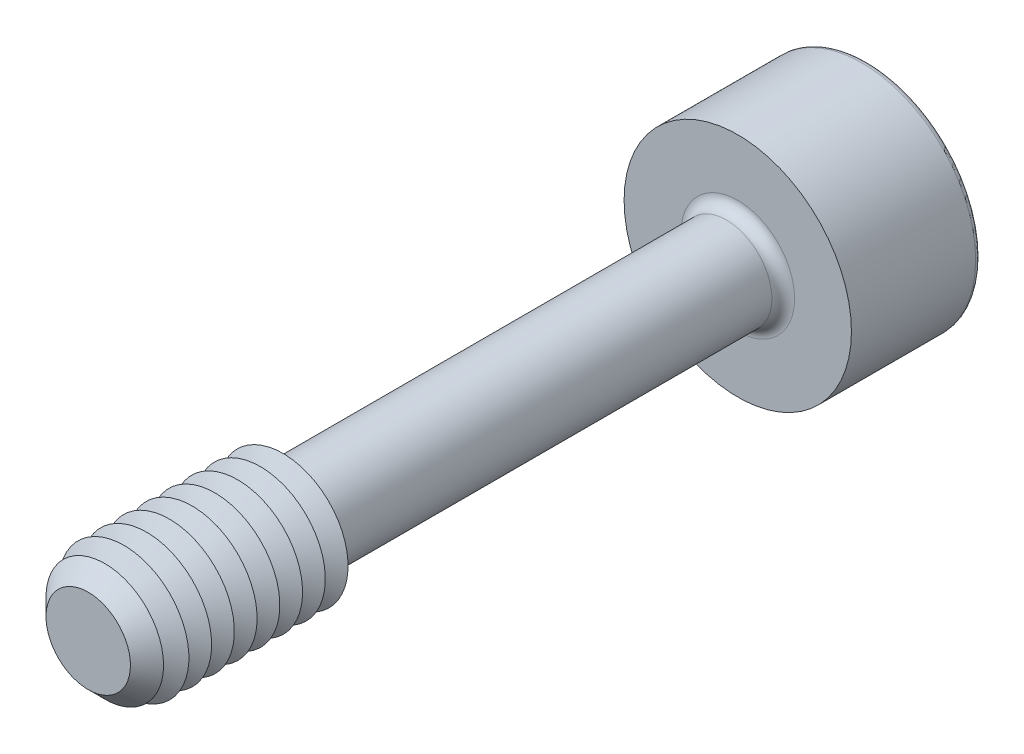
ISO-10303-21;
HEADER;
FILE_DESCRIPTION(('STEP AP214'),'2;1');
FILE_NAME('part.step','',(''),(''),'','','');
FILE_SCHEMA(('AUTOMOTIVE_DESIGN { 1 0 10303 214 1 1 1 1 }'));
ENDSEC;
DATA;
#1=APPLICATION_CONTEXT('core data for automotive mechanical design processes');
#2=APPLICATION_PROTOCOL_DEFINITION('international standard','automotive_design',2000,#1);
#3=PRODUCT_CONTEXT('',#1,'mechanical');
#4=PRODUCT('Part','Part','',(#3));
#5=PRODUCT_RELATED_PRODUCT_CATEGORY('part','',(#4));
#6=PRODUCT_DEFINITION_FORMATION('','',#4);
#7=PRODUCT_DEFINITION_CONTEXT('part definition',#1,'design');
#8=PRODUCT_DEFINITION('design','',#6,#7);
#9=PRODUCT_DEFINITION_SHAPE('','',#8);
#10=(LENGTH_UNIT() NAMED_UNIT(*) SI_UNIT(.MILLI.,.METRE.));
#11=(NAMED_UNIT(*) PLANE_ANGLE_UNIT() SI_UNIT($,.RADIAN.));
#12=(NAMED_UNIT(*) SI_UNIT($,.STERADIAN.) SOLID_ANGLE_UNIT());
#13=UNCERTAINTY_MEASURE_WITH_UNIT(LENGTH_MEASURE(1.E-05),#10,'distance_accuracy_value','');
#14=(GEOMETRIC_REPRESENTATION_CONTEXT(3) GLOBAL_UNCERTAINTY_ASSIGNED_CONTEXT((#13)) GLOBAL_UNIT_ASSIGNED_CONTEXT((#10,
#11,#12)) REPRESENTATION_CONTEXT('',''));
#15=CARTESIAN_POINT('',(0.,0.,0.));
#16=DIRECTION('',(0.,0.,1.));
#17=DIRECTION('',(1.,0.,0.));
#18=AXIS2_PLACEMENT_3D('',#15,#16,#17);
#19=CARTESIAN_POINT('',(-0.866025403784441,-1.5,-11.));
#20=DIRECTION('',(0.,0.,1.));
#21=DIRECTION('',(1.,0.,0.));
#22=AXIS2_PLACEMENT_3D('',#19,#20,#21);
#23=PLANE('',#22);
#24=DIRECTION('',(1.,0.,0.));
#25=VECTOR('',#24,1.);
#26=CARTESIAN_POINT('',(-0.866025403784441,-1.5,-11.));
#27=LINE('',#26,#25);
#28=CARTESIAN_POINT('',(0.,-1.5,-11.));
#29=VERTEX_POINT('',#28);
#30=CARTESIAN_POINT('',(0.866025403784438,-1.5,-11.));
#31=VERTEX_POINT('',#30);
#32=EDGE_CURVE('E761',#29,#31,#27,.T.);
#33=ORIENTED_EDGE('',*,*,#32,.F.);
#34=CARTESIAN_POINT('',(0.,0.,-11.));
#35=DIRECTION('',(0.,0.,1.));
#36=DIRECTION('',(0.,-1.,0.));
#37=AXIS2_PLACEMENT_3D('',#34,#35,#36);
#38=CIRCLE('',#37,1.5);
#39=CARTESIAN_POINT('',(1.29903810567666,-0.75,-11.));
#40=VERTEX_POINT('',#39);
#41=EDGE_CURVE('E53',#29,#40,#38,.T.);
#42=ORIENTED_EDGE('',*,*,#41,.T.);
#43=DIRECTION('',(0.5,0.866025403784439,0.));
#44=VECTOR('',#43,1.);
#45=CARTESIAN_POINT('',(0.866025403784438,-1.5,-11.));
#46=LINE('',#45,#44);
#47=EDGE_CURVE('E747',#31,#40,#46,.T.);
#48=ORIENTED_EDGE('',*,*,#47,.F.);
#49=EDGE_LOOP('',(#33,#42,#48));
#50=FACE_BOUND('',#49,.T.);
#51=ADVANCED_FACE('F41',(#50),#23,.F.);
#52=CARTESIAN_POINT('',(1.73205080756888,0.,-11.));
#53=VERTEX_POINT('',#52);
#54=EDGE_CURVE('E758',#40,#53,#46,.T.);
#55=ORIENTED_EDGE('',*,*,#54,.F.);
#56=CARTESIAN_POINT('',(1.29903810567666,0.749999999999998,-11.));
#57=VERTEX_POINT('',#56);
#58=EDGE_CURVE('E11',#40,#57,#38,.T.);
#59=ORIENTED_EDGE('',*,*,#58,.T.);
#60=DIRECTION('',(-0.5,0.866025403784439,0.));
#61=VECTOR('',#60,1.);
#62=CARTESIAN_POINT('',(1.73205080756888,0.,-11.));
#63=LINE('',#62,#61);
#64=EDGE_CURVE('E746',#53,#57,#63,.T.);
#65=ORIENTED_EDGE('',*,*,#64,.F.);
#66=EDGE_LOOP('',(#55,#59,#65));
#67=FACE_BOUND('',#66,.T.);
#68=ADVANCED_FACE('F133',(#67),#23,.F.);
#69=CARTESIAN_POINT('',(0.866025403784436,1.5,-11.));
#70=VERTEX_POINT('',#69);
#71=EDGE_CURVE('E741',#57,#70,#63,.T.);
#72=ORIENTED_EDGE('',*,*,#71,.F.);
#73=CARTESIAN_POINT('',(0.,1.5,-11.));
#74=VERTEX_POINT('',#73);
#75=EDGE_CURVE('E51',#57,#74,#38,.T.);
#76=ORIENTED_EDGE('',*,*,#75,.T.);
#77=DIRECTION('',(-1.,0.,0.));
#78=VECTOR('',#77,1.);
#79=CARTESIAN_POINT('',(0.866025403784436,1.5,-11.));
#80=LINE('',#79,#78);
#81=EDGE_CURVE('E177',#70,#74,#80,.T.);
#82=ORIENTED_EDGE('',*,*,#81,.F.);
#83=EDGE_LOOP('',(#72,#76,#82));
#84=FACE_BOUND('',#83,.T.);
#85=ADVANCED_FACE('F139',(#84),#23,.F.);
#86=CARTESIAN_POINT('',(-0.866025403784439,1.5,-11.));
#87=VERTEX_POINT('',#86);
#88=EDGE_CURVE('E752',#74,#87,#80,.T.);
#89=ORIENTED_EDGE('',*,*,#88,.F.);
#90=CARTESIAN_POINT('',(-1.29903810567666,0.749999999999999,-11.));
#91=VERTEX_POINT('',#90);
#92=EDGE_CURVE('E264',#74,#91,#38,.T.);
#93=ORIENTED_EDGE('',*,*,#92,.T.);
#94=DIRECTION('',(-0.5,-0.866025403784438,0.));
#95=VECTOR('',#94,1.);
#96=CARTESIAN_POINT('',(-0.866025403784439,1.5,-11.));
#97=LINE('',#96,#95);
#98=EDGE_CURVE('E176',#87,#91,#97,.T.);
#99=ORIENTED_EDGE('',*,*,#98,.F.);
#100=EDGE_LOOP('',(#89,#93,#99));
#101=FACE_BOUND('',#100,.T.);
#102=ADVANCED_FACE('F157',(#101),#23,.F.);
#103=CARTESIAN_POINT('',(-1.73205080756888,0.,-11.));
#104=VERTEX_POINT('',#103);
#105=EDGE_CURVE('E170',#91,#104,#97,.T.);
#106=ORIENTED_EDGE('',*,*,#105,.F.);
#107=CARTESIAN_POINT('',(-1.29903810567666,-0.749999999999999,-11.));
#108=VERTEX_POINT('',#107);
#109=EDGE_CURVE('E172',#91,#108,#38,.T.);
#110=ORIENTED_EDGE('',*,*,#109,.T.);
#111=DIRECTION('',(0.5,-0.866025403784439,0.));
#112=VECTOR('',#111,1.);
#113=CARTESIAN_POINT('',(-1.73205080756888,0.,-11.));
#114=LINE('',#113,#112);
#115=EDGE_CURVE('E174',#104,#108,#114,.T.);
#116=ORIENTED_EDGE('',*,*,#115,.F.);
#117=EDGE_LOOP('',(#106,#110,#116));
#118=FACE_BOUND('',#117,.T.);
#119=ADVANCED_FACE('F146',(#118),#23,.F.);
#120=CARTESIAN_POINT('',(0.,0.,-14.));
#121=DIRECTION('',(0.,0.,-1.));
#122=DIRECTION('',(-1.,0.,0.));
#123=AXIS2_PLACEMENT_3D('',#120,#121,#122);
#124=PLANE('',#123);
#125=CARTESIAN_POINT('',(0.,0.,-14.));
#126=DIRECTION('',(0.,0.,-1.));
#127=DIRECTION('',(-1.,0.,0.));
#128=AXIS2_PLACEMENT_3D('',#125,#126,#127);
#129=CIRCLE('',#128,3.325);
#130=CARTESIAN_POINT('',(-3.325,0.,-14.));
#131=VERTEX_POINT('',#130);
#132=EDGE_CURVE('E251',#131,#131,#129,.T.);
#133=ORIENTED_EDGE('',*,*,#132,.T.);
#134=EDGE_LOOP('',(#133));
#135=FACE_BOUND('',#134,.T.);
#136=DIRECTION('',(-0.5,-0.866025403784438,0.));
#137=VECTOR('',#136,1.);
#138=CARTESIAN_POINT('',(-0.866025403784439,1.5,-14.));
#139=LINE('',#138,#137);
#140=CARTESIAN_POINT('',(-0.866025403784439,1.5,-14.));
#141=VERTEX_POINT('',#140);
#142=CARTESIAN_POINT('',(-1.73205080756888,0.,-14.));
#143=VERTEX_POINT('',#142);
#144=EDGE_CURVE('E212',#141,#143,#139,.T.);
#145=ORIENTED_EDGE('',*,*,#144,.T.);
#146=DIRECTION('',(0.5,-0.866025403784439,0.));
#147=VECTOR('',#146,1.);
#148=CARTESIAN_POINT('',(-1.73205080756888,0.,-14.));
#149=LINE('',#148,#147);
#150=CARTESIAN_POINT('',(-0.866025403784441,-1.5,-14.));
#151=VERTEX_POINT('',#150);
#152=EDGE_CURVE('E67',#143,#151,#149,.T.);
#153=ORIENTED_EDGE('',*,*,#152,.T.);
#154=DIRECTION('',(1.,0.,0.));
#155=VECTOR('',#154,1.);
#156=CARTESIAN_POINT('',(-0.866025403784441,-1.5,-14.));
#157=LINE('',#156,#155);
#158=CARTESIAN_POINT('',(0.866025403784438,-1.5,-14.));
#159=VERTEX_POINT('',#158);
#160=EDGE_CURVE('E196',#151,#159,#157,.T.);
#161=ORIENTED_EDGE('',*,*,#160,.T.);
#162=DIRECTION('',(0.5,0.866025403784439,0.));
#163=VECTOR('',#162,1.);
#164=CARTESIAN_POINT('',(0.866025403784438,-1.5,-14.));
#165=LINE('',#164,#163);
#166=CARTESIAN_POINT('',(1.73205080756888,0.,-14.));
#167=VERTEX_POINT('',#166);
#168=EDGE_CURVE('E200',#159,#167,#165,.T.);
#169=ORIENTED_EDGE('',*,*,#168,.T.);
#170=DIRECTION('',(-0.5,0.866025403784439,0.));
#171=VECTOR('',#170,1.);
#172=CARTESIAN_POINT('',(1.73205080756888,0.,-14.));
#173=LINE('',#172,#171);
#174=CARTESIAN_POINT('',(0.866025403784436,1.5,-14.));
#175=VERTEX_POINT('',#174);
#176=EDGE_CURVE('E204',#167,#175,#173,.T.);
#177=ORIENTED_EDGE('',*,*,#176,.T.);
#178=DIRECTION('',(-1.,0.,0.));
#179=VECTOR('',#178,1.);
#180=CARTESIAN_POINT('',(0.866025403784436,1.5,-14.));
#181=LINE('',#180,#179);
#182=EDGE_CURVE('E208',#175,#141,#181,.T.);
#183=ORIENTED_EDGE('',*,*,#182,.T.);
#184=EDGE_LOOP('',(#145,#153,#161,#169,#177,#183));
#185=FACE_BOUND('',#184,.T.);
#186=ADVANCED_FACE('F156',(#135,#185),#124,.T.);
#187=CARTESIAN_POINT('',(0.,0.,10.));
#188=DIRECTION('',(0.,0.,-1.));
#189=DIRECTION('',(-1.,0.,0.));
#190=AXIS2_PLACEMENT_3D('',#187,#188,#189);
#191=CYLINDRICAL_SURFACE('',#190,1.4);
#192=CARTESIAN_POINT('',(0.,0.,-9.65));
#193=DIRECTION('',(0.,0.,-1.));
#194=DIRECTION('',(-1.,0.,0.));
#195=AXIS2_PLACEMENT_3D('',#192,#193,#194);
#196=CIRCLE('',#195,1.4);
#197=CARTESIAN_POINT('',(-1.4,0.,-9.65));
#198=VERTEX_POINT('',#197);
#199=EDGE_CURVE('E247',#198,#198,#196,.F.);
#200=ORIENTED_EDGE('',*,*,#199,.T.);
#201=EDGE_LOOP('',(#200));
#202=FACE_BOUND('',#201,.T.);
#203=CARTESIAN_POINT('',(0.,0.,3.65358983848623));
#204=DIRECTION('',(0.,0.,-1.));
#205=DIRECTION('',(0.,1.,0.));
#206=AXIS2_PLACEMENT_3D('',#203,#204,#205);
#207=CIRCLE('',#206,1.4);
#208=CARTESIAN_POINT('',(0.,1.4,3.65358983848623));
#209=VERTEX_POINT('',#208);
#210=EDGE_CURVE('E235',#209,#209,#207,.T.);
#211=ORIENTED_EDGE('',*,*,#210,.T.);
#212=EDGE_LOOP('',(#211));
#213=FACE_BOUND('',#212,.T.);
#214=ADVANCED_FACE('F163',(#202,#213),#191,.T.);
#215=CARTESIAN_POINT('',(0.,0.,3.65358983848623));
#216=DIRECTION('',(0.,0.,1.));
#217=DIRECTION('',(0.,-1.,0.));
#218=AXIS2_PLACEMENT_3D('',#215,#216,#217);
#219=CONICAL_SURFACE('',#218,1.4,1.0471975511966);
#220=CARTESIAN_POINT('',(0.,0.,4.));
#221=DIRECTION('',(0.,0.,-1.));
#222=DIRECTION('',(-1.,0.,0.));
#223=AXIS2_PLACEMENT_3D('',#220,#221,#222);
#224=CIRCLE('',#223,2.);
#225=CARTESIAN_POINT('',(-2.,0.,4.));
#226=VERTEX_POINT('',#225);
#227=EDGE_CURVE('E268',#226,#226,#224,.T.);
#228=ORIENTED_EDGE('',*,*,#227,.T.);
#229=EDGE_LOOP('',(#228));
#230=FACE_BOUND('',#229,.T.);
#231=ORIENTED_EDGE('',*,*,#210,.F.);
#232=EDGE_LOOP('',(#231));
#233=FACE_BOUND('',#232,.T.);
#234=ADVANCED_FACE('F510',(#230,#233),#219,.T.);
#235=CARTESIAN_POINT('',(0.,0.,-10.));
#236=DIRECTION('',(0.,0.,-1.));
#237=DIRECTION('',(-1.,0.,0.));
#238=AXIS2_PLACEMENT_3D('',#235,#236,#237);
#239=PLANE('',#238);
#240=CARTESIAN_POINT('',(0.,0.,-10.));
#241=DIRECTION('',(0.,0.,-1.));
#242=DIRECTION('',(-1.,0.,0.));
#243=AXIS2_PLACEMENT_3D('',#240,#241,#242);
#244=CIRCLE('',#243,1.75);
#245=CARTESIAN_POINT('',(-1.75,0.,-10.));
#246=VERTEX_POINT('',#245);
#247=EDGE_CURVE('E243',#246,#246,#244,.T.);
#248=ORIENTED_EDGE('',*,*,#247,.T.);
#249=EDGE_LOOP('',(#248));
#250=FACE_BOUND('',#249,.T.);
#251=CARTESIAN_POINT('',(0.,0.,-10.));
#252=DIRECTION('',(0.,0.,-1.));
#253=DIRECTION('',(-1.,0.,0.));
#254=AXIS2_PLACEMENT_3D('',#251,#252,#253);
#255=CIRCLE('',#254,3.5);
#256=CARTESIAN_POINT('',(-3.5,0.,-10.));
#257=VERTEX_POINT('',#256);
#258=EDGE_CURVE('E231',#257,#257,#255,.T.);
#259=ORIENTED_EDGE('',*,*,#258,.F.);
#260=EDGE_LOOP('',(#259));
#261=FACE_BOUND('',#260,.T.);
#262=ADVANCED_FACE('F503',(#250,#261),#239,.F.);
#263=CARTESIAN_POINT('',(0.,0.,-14.));
#264=DIRECTION('',(0.,0.,1.));
#265=DIRECTION('',(1.,0.,0.));
#266=AXIS2_PLACEMENT_3D('',#263,#264,#265);
#267=CYLINDRICAL_SURFACE('',#266,3.5);
#268=CARTESIAN_POINT('',(0.,0.,-13.825));
#269=DIRECTION('',(0.,0.,-1.));
#270=DIRECTION('',(-1.,0.,0.));
#271=AXIS2_PLACEMENT_3D('',#268,#269,#270);
#272=CIRCLE('',#271,3.5);
#273=CARTESIAN_POINT('',(-3.5,0.,-13.825));
#274=VERTEX_POINT('',#273);
#275=EDGE_CURVE('E254',#274,#274,#272,.F.);
#276=ORIENTED_EDGE('',*,*,#275,.T.);
#277=EDGE_LOOP('',(#276));
#278=FACE_BOUND('',#277,.T.);
#279=ORIENTED_EDGE('',*,*,#258,.T.);
#280=EDGE_LOOP('',(#279));
#281=FACE_BOUND('',#280,.T.);
#282=ADVANCED_FACE('F509',(#278,#281),#267,.T.);
#283=CARTESIAN_POINT('',(-1.73205080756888,0.,-11.));
#284=DIRECTION('',(0.866025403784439,0.5,0.));
#285=DIRECTION('',(-0.5,0.866025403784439,0.));
#286=AXIS2_PLACEMENT_3D('',#283,#284,#285);
#287=PLANE('',#286);
#288=ORIENTED_EDGE('',*,*,#152,.F.);
#289=DIRECTION('',(0.,0.,-1.));
#290=VECTOR('',#289,1.);
#291=CARTESIAN_POINT('',(-1.73205080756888,0.,-11.));
#292=LINE('',#291,#290);
#293=EDGE_CURVE('E186',#104,#143,#292,.T.);
#294=ORIENTED_EDGE('',*,*,#293,.F.);
#295=ORIENTED_EDGE('',*,*,#115,.T.);
#296=CARTESIAN_POINT('',(-0.866025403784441,-1.5,-11.));
#297=VERTEX_POINT('',#296);
#298=EDGE_CURVE('E215',#108,#297,#114,.T.);
#299=ORIENTED_EDGE('',*,*,#298,.T.);
#300=DIRECTION('',(0.,0.,-1.));
#301=VECTOR('',#300,1.);
#302=CARTESIAN_POINT('',(-0.866025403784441,-1.5,-11.));
#303=LINE('',#302,#301);
#304=EDGE_CURVE('E228',#297,#151,#303,.T.);
#305=ORIENTED_EDGE('',*,*,#304,.T.);
#306=EDGE_LOOP('',(#288,#294,#295,#299,#305));
#307=FACE_BOUND('',#306,.T.);
#308=ADVANCED_FACE('F521',(#307),#287,.T.);
#309=CARTESIAN_POINT('',(-0.866025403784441,-1.5,-11.));
#310=DIRECTION('',(0.,1.,0.));
#311=DIRECTION('',(0.,0.,1.));
#312=AXIS2_PLACEMENT_3D('',#309,#310,#311);
#313=PLANE('',#312);
#314=ORIENTED_EDGE('',*,*,#160,.F.);
#315=ORIENTED_EDGE('',*,*,#304,.F.);
#316=EDGE_CURVE('E759',#297,#29,#27,.T.);
#317=ORIENTED_EDGE('',*,*,#316,.T.);
#318=ORIENTED_EDGE('',*,*,#32,.T.);
#319=DIRECTION('',(0.,0.,-1.));
#320=VECTOR('',#319,1.);
#321=CARTESIAN_POINT('',(0.866025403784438,-1.5,-11.));
#322=LINE('',#321,#320);
#323=EDGE_CURVE('E225',#31,#159,#322,.T.);
#324=ORIENTED_EDGE('',*,*,#323,.T.);
#325=EDGE_LOOP('',(#314,#315,#317,#318,#324));
#326=FACE_BOUND('',#325,.T.);
#327=ADVANCED_FACE('F537',(#326),#313,.T.);
#328=CARTESIAN_POINT('',(0.866025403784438,-1.5,-11.));
#329=DIRECTION('',(-0.866025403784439,0.5,0.));
#330=DIRECTION('',(-0.5,-0.866025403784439,0.));
#331=AXIS2_PLACEMENT_3D('',#328,#329,#330);
#332=PLANE('',#331);
#333=ORIENTED_EDGE('',*,*,#168,.F.);
#334=ORIENTED_EDGE('',*,*,#323,.F.);
#335=ORIENTED_EDGE('',*,*,#47,.T.);
#336=ORIENTED_EDGE('',*,*,#54,.T.);
#337=DIRECTION('',(0.,0.,-1.));
#338=VECTOR('',#337,1.);
#339=CARTESIAN_POINT('',(1.73205080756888,0.,-11.));
#340=LINE('',#339,#338);
#341=EDGE_CURVE('E222',#53,#167,#340,.T.);
#342=ORIENTED_EDGE('',*,*,#341,.T.);
#343=EDGE_LOOP('',(#333,#334,#335,#336,#342));
#344=FACE_BOUND('',#343,.T.);
#345=ADVANCED_FACE('F547',(#344),#332,.T.);
#346=CARTESIAN_POINT('',(1.73205080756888,0.,-11.));
#347=DIRECTION('',(-0.866025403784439,-0.5,0.));
#348=DIRECTION('',(0.5,-0.866025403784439,0.));
#349=AXIS2_PLACEMENT_3D('',#346,#347,#348);
#350=PLANE('',#349);
#351=ORIENTED_EDGE('',*,*,#176,.F.);
#352=ORIENTED_EDGE('',*,*,#341,.F.);
#353=ORIENTED_EDGE('',*,*,#64,.T.);
#354=ORIENTED_EDGE('',*,*,#71,.T.);
#355=DIRECTION('',(0.,0.,-1.));
#356=VECTOR('',#355,1.);
#357=CARTESIAN_POINT('',(0.866025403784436,1.5,-11.));
#358=LINE('',#357,#356);
#359=EDGE_CURVE('E219',#70,#175,#358,.T.);
#360=ORIENTED_EDGE('',*,*,#359,.T.);
#361=EDGE_LOOP('',(#351,#352,#353,#354,#360));
#362=FACE_BOUND('',#361,.T.);
#363=ADVANCED_FACE('F557',(#362),#350,.T.);
#364=CARTESIAN_POINT('',(0.866025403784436,1.5,-11.));
#365=DIRECTION('',(0.,-1.,0.));
#366=DIRECTION('',(0.,0.,-1.));
#367=AXIS2_PLACEMENT_3D('',#364,#365,#366);
#368=PLANE('',#367);
#369=ORIENTED_EDGE('',*,*,#182,.F.);
#370=ORIENTED_EDGE('',*,*,#359,.F.);
#371=ORIENTED_EDGE('',*,*,#81,.T.);
#372=ORIENTED_EDGE('',*,*,#88,.T.);
#373=DIRECTION('',(0.,0.,-1.));
#374=VECTOR('',#373,1.);
#375=CARTESIAN_POINT('',(-0.866025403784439,1.5,-11.));
#376=LINE('',#375,#374);
#377=EDGE_CURVE('E182',#87,#141,#376,.T.);
#378=ORIENTED_EDGE('',*,*,#377,.T.);
#379=EDGE_LOOP('',(#369,#370,#371,#372,#378));
#380=FACE_BOUND('',#379,.T.);
#381=ADVANCED_FACE('F152',(#380),#368,.T.);
#382=CARTESIAN_POINT('',(-0.866025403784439,1.5,-11.));
#383=DIRECTION('',(0.866025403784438,-0.5,0.));
#384=DIRECTION('',(0.5,0.866025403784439,0.));
#385=AXIS2_PLACEMENT_3D('',#382,#383,#384);
#386=PLANE('',#385);
#387=ORIENTED_EDGE('',*,*,#144,.F.);
#388=ORIENTED_EDGE('',*,*,#377,.F.);
#389=ORIENTED_EDGE('',*,*,#98,.T.);
#390=ORIENTED_EDGE('',*,*,#105,.T.);
#391=ORIENTED_EDGE('',*,*,#293,.T.);
#392=EDGE_LOOP('',(#387,#388,#389,#390,#391));
#393=FACE_BOUND('',#392,.T.);
#394=ADVANCED_FACE('F144',(#393),#386,.T.);
#395=ORIENTED_EDGE('',*,*,#298,.F.);
#396=EDGE_CURVE('E257',#108,#29,#38,.T.);
#397=ORIENTED_EDGE('',*,*,#396,.T.);
#398=ORIENTED_EDGE('',*,*,#316,.F.);
#399=EDGE_LOOP('',(#395,#397,#398));
#400=FACE_BOUND('',#399,.T.);
#401=ADVANCED_FACE('F135',(#400),#23,.F.);
#402=CARTESIAN_POINT('',(0.,0.,-9.65));
#403=DIRECTION('',(0.,0.,-1.));
#404=DIRECTION('',(-1.,0.,0.));
#405=AXIS2_PLACEMENT_3D('',#402,#403,#404);
#406=TOROIDAL_SURFACE('',#405,1.75,0.35);
#407=ORIENTED_EDGE('',*,*,#199,.F.);
#408=EDGE_LOOP('',(#407));
#409=FACE_BOUND('',#408,.T.);
#410=ORIENTED_EDGE('',*,*,#247,.F.);
#411=EDGE_LOOP('',(#410));
#412=FACE_BOUND('',#411,.T.);
#413=ADVANCED_FACE('F129',(#409,#412),#406,.F.);
#414=CARTESIAN_POINT('',(0.,0.,-13.825));
#415=DIRECTION('',(0.,0.,-1.));
#416=DIRECTION('',(-1.,0.,0.));
#417=AXIS2_PLACEMENT_3D('',#414,#415,#416);
#418=TOROIDAL_SURFACE('',#417,3.325,0.175);
#419=ORIENTED_EDGE('',*,*,#275,.F.);
#420=EDGE_LOOP('',(#419));
#421=FACE_BOUND('',#420,.T.);
#422=ORIENTED_EDGE('',*,*,#132,.F.);
#423=EDGE_LOOP('',(#422));
#424=FACE_BOUND('',#423,.T.);
#425=ADVANCED_FACE('F43',(#421,#424),#418,.T.);
#426=CARTESIAN_POINT('',(0.,0.,-10.1339745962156));
#427=DIRECTION('',(0.,0.,-1.));
#428=DIRECTION('',(0.,1.,0.));
#429=AXIS2_PLACEMENT_3D('',#426,#427,#428);
#430=CONICAL_SURFACE('',#429,0.,1.0471975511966);
#431=ORIENTED_EDGE('',*,*,#41,.F.);
#432=ORIENTED_EDGE('',*,*,#396,.F.);
#433=ORIENTED_EDGE('',*,*,#109,.F.);
#434=ORIENTED_EDGE('',*,*,#92,.F.);
#435=ORIENTED_EDGE('',*,*,#75,.F.);
#436=ORIENTED_EDGE('',*,*,#58,.F.);
#437=EDGE_LOOP('',(#431,#432,#433,#434,#435,#436));
#438=FACE_BOUND('',#437,.T.);
#439=CARTESIAN_POINT('',(0.,0.,-10.1339745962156));
#440=VERTEX_POINT('',#439);
#441=VERTEX_LOOP('',#440);
#442=FACE_BOUND('',#441,.T.);
#443=ADVANCED_FACE('F118',(#438,#442),#430,.F.);
#444=CARTESIAN_POINT('',(0.,0.,4.35));
#445=DIRECTION('',(0.,0.,-1.));
#446=DIRECTION('',(-1.,0.,0.));
#447=AXIS2_PLACEMENT_3D('',#444,#445,#446);
#448=CONICAL_SURFACE('',#447,1.39378221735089,1.0471975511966);
#449=ORIENTED_EDGE('',*,*,#227,.F.);
#450=EDGE_LOOP('',(#449));
#451=FACE_BOUND('',#450,.T.);
#452=CARTESIAN_POINT('',(0.,0.,4.35));
#453=DIRECTION('',(0.,0.,-1.));
#454=DIRECTION('',(-1.,0.,0.));
#455=AXIS2_PLACEMENT_3D('',#452,#453,#454);
#456=CIRCLE('',#455,1.39378221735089);
#457=CARTESIAN_POINT('',(-1.39378221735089,0.,4.35));
#458=VERTEX_POINT('',#457);
#459=EDGE_CURVE('E275',#458,#458,#456,.T.);
#460=ORIENTED_EDGE('',*,*,#459,.T.);
#461=EDGE_LOOP('',(#460));
#462=FACE_BOUND('',#461,.T.);
#463=ADVANCED_FACE('F120',(#451,#462),#448,.T.);
#464=CARTESIAN_POINT('',(0.,0.,4.7));
#465=DIRECTION('',(0.,0.,1.));
#466=DIRECTION('',(1.,0.,0.));
#467=AXIS2_PLACEMENT_3D('',#464,#465,#466);
#468=CONICAL_SURFACE('',#467,2.,1.0471975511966);
#469=ORIENTED_EDGE('',*,*,#459,.F.);
#470=EDGE_LOOP('',(#469));
#471=FACE_BOUND('',#470,.T.);
#472=CARTESIAN_POINT('',(0.,0.,4.7));
#473=DIRECTION('',(0.,0.,-1.));
#474=DIRECTION('',(-1.,0.,0.));
#475=AXIS2_PLACEMENT_3D('',#472,#473,#474);
#476=CIRCLE('',#475,2.);
#477=CARTESIAN_POINT('',(-2.,0.,4.7));
#478=VERTEX_POINT('',#477);
#479=EDGE_CURVE('E281',#478,#478,#476,.T.);
#480=ORIENTED_EDGE('',*,*,#479,.T.);
#481=EDGE_LOOP('',(#480));
#482=FACE_BOUND('',#481,.T.);
#483=ADVANCED_FACE('F126',(#471,#482),#468,.T.);
#484=CARTESIAN_POINT('',(0.,0.,5.05));
#485=DIRECTION('',(0.,0.,-1.));
#486=DIRECTION('',(-1.,0.,0.));
#487=AXIS2_PLACEMENT_3D('',#484,#485,#486);
#488=CONICAL_SURFACE('',#487,1.39378221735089,1.0471975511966);
#489=ORIENTED_EDGE('',*,*,#479,.F.);
#490=EDGE_LOOP('',(#489));
#491=FACE_BOUND('',#490,.T.);
#492=CARTESIAN_POINT('',(0.,0.,5.05));
#493=DIRECTION('',(0.,0.,-1.));
#494=DIRECTION('',(-1.,0.,0.));
#495=AXIS2_PLACEMENT_3D('',#492,#493,#494);
#496=CIRCLE('',#495,1.39378221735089);
#497=CARTESIAN_POINT('',(-1.39378221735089,0.,5.05));
#498=VERTEX_POINT('',#497);
#499=EDGE_CURVE('E286',#498,#498,#496,.T.);
#500=ORIENTED_EDGE('',*,*,#499,.T.);
#501=EDGE_LOOP('',(#500));
#502=FACE_BOUND('',#501,.T.);
#503=ADVANCED_FACE('F397',(#491,#502),#488,.T.);
#504=CARTESIAN_POINT('',(0.,0.,5.4));
#505=DIRECTION('',(0.,0.,1.));
#506=DIRECTION('',(1.,0.,0.));
#507=AXIS2_PLACEMENT_3D('',#504,#505,#506);
#508=CONICAL_SURFACE('',#507,2.,1.0471975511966);
#509=ORIENTED_EDGE('',*,*,#499,.F.);
#510=EDGE_LOOP('',(#509));
#511=FACE_BOUND('',#510,.T.);
#512=CARTESIAN_POINT('',(0.,0.,5.4));
#513=DIRECTION('',(0.,0.,-1.));
#514=DIRECTION('',(-1.,0.,0.));
#515=AXIS2_PLACEMENT_3D('',#512,#513,#514);
#516=CIRCLE('',#515,2.);
#517=CARTESIAN_POINT('',(-2.,0.,5.4));
#518=VERTEX_POINT('',#517);
#519=EDGE_CURVE('E289',#518,#518,#516,.T.);
#520=ORIENTED_EDGE('',*,*,#519,.T.);
#521=EDGE_LOOP('',(#520));
#522=FACE_BOUND('',#521,.T.);
#523=ADVANCED_FACE('F393',(#511,#522),#508,.T.);
#524=CARTESIAN_POINT('',(0.,0.,5.75));
#525=DIRECTION('',(0.,0.,-1.));
#526=DIRECTION('',(-1.,0.,0.));
#527=AXIS2_PLACEMENT_3D('',#524,#525,#526);
#528=CONICAL_SURFACE('',#527,1.39378221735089,1.0471975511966);
#529=ORIENTED_EDGE('',*,*,#519,.F.);
#530=EDGE_LOOP('',(#529));
#531=FACE_BOUND('',#530,.T.);
#532=CARTESIAN_POINT('',(0.,0.,5.75));
#533=DIRECTION('',(0.,0.,-1.));
#534=DIRECTION('',(-1.,0.,0.));
#535=AXIS2_PLACEMENT_3D('',#532,#533,#534);
#536=CIRCLE('',#535,1.39378221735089);
#537=CARTESIAN_POINT('',(-1.39378221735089,0.,5.75));
#538=VERTEX_POINT('',#537);
#539=EDGE_CURVE('E293',#538,#538,#536,.T.);
#540=ORIENTED_EDGE('',*,*,#539,.T.);
#541=EDGE_LOOP('',(#540));
#542=FACE_BOUND('',#541,.T.);
#543=ADVANCED_FACE('F389',(#531,#542),#528,.T.);
#544=CARTESIAN_POINT('',(0.,0.,6.1));
#545=DIRECTION('',(0.,0.,1.));
#546=DIRECTION('',(1.,0.,0.));
#547=AXIS2_PLACEMENT_3D('',#544,#545,#546);
#548=CONICAL_SURFACE('',#547,2.,1.0471975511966);
#549=ORIENTED_EDGE('',*,*,#539,.F.);
#550=EDGE_LOOP('',(#549));
#551=FACE_BOUND('',#550,.T.);
#552=CARTESIAN_POINT('',(0.,0.,6.1));
#553=DIRECTION('',(0.,0.,-1.));
#554=DIRECTION('',(-1.,0.,0.));
#555=AXIS2_PLACEMENT_3D('',#552,#553,#554);
#556=CIRCLE('',#555,2.);
#557=CARTESIAN_POINT('',(-2.,0.,6.1));
#558=VERTEX_POINT('',#557);
#559=EDGE_CURVE('E296',#558,#558,#556,.T.);
#560=ORIENTED_EDGE('',*,*,#559,.T.);
#561=EDGE_LOOP('',(#560));
#562=FACE_BOUND('',#561,.T.);
#563=ADVANCED_FACE('F385',(#551,#562),#548,.T.);
#564=CARTESIAN_POINT('',(0.,0.,6.45));
#565=DIRECTION('',(0.,0.,-1.));
#566=DIRECTION('',(-1.,0.,0.));
#567=AXIS2_PLACEMENT_3D('',#564,#565,#566);
#568=CONICAL_SURFACE('',#567,1.39378221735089,1.0471975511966);
#569=ORIENTED_EDGE('',*,*,#559,.F.);
#570=EDGE_LOOP('',(#569));
#571=FACE_BOUND('',#570,.T.);
#572=CARTESIAN_POINT('',(0.,0.,6.45));
#573=DIRECTION('',(0.,0.,-1.));
#574=DIRECTION('',(-1.,0.,0.));
#575=AXIS2_PLACEMENT_3D('',#572,#573,#574);
#576=CIRCLE('',#575,1.39378221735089);
#577=CARTESIAN_POINT('',(-1.39378221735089,0.,6.45));
#578=VERTEX_POINT('',#577);
#579=EDGE_CURVE('E300',#578,#578,#576,.T.);
#580=ORIENTED_EDGE('',*,*,#579,.T.);
#581=EDGE_LOOP('',(#580));
#582=FACE_BOUND('',#581,.T.);
#583=ADVANCED_FACE('F381',(#571,#582),#568,.T.);
#584=CARTESIAN_POINT('',(0.,0.,6.8));
#585=DIRECTION('',(0.,0.,1.));
#586=DIRECTION('',(1.,0.,0.));
#587=AXIS2_PLACEMENT_3D('',#584,#585,#586);
#588=CONICAL_SURFACE('',#587,2.,1.0471975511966);
#589=ORIENTED_EDGE('',*,*,#579,.F.);
#590=EDGE_LOOP('',(#589));
#591=FACE_BOUND('',#590,.T.);
#592=CARTESIAN_POINT('',(0.,0.,6.8));
#593=DIRECTION('',(0.,0.,-1.));
#594=DIRECTION('',(-1.,0.,0.));
#595=AXIS2_PLACEMENT_3D('',#592,#593,#594);
#596=CIRCLE('',#595,2.);
#597=CARTESIAN_POINT('',(-2.,0.,6.8));
#598=VERTEX_POINT('',#597);
#599=EDGE_CURVE('E304',#598,#598,#596,.T.);
#600=ORIENTED_EDGE('',*,*,#599,.T.);
#601=EDGE_LOOP('',(#600));
#602=FACE_BOUND('',#601,.T.);
#603=ADVANCED_FACE('F377',(#591,#602),#588,.T.);
#604=CARTESIAN_POINT('',(0.,0.,7.15));
#605=DIRECTION('',(0.,0.,-1.));
#606=DIRECTION('',(-1.,0.,0.));
#607=AXIS2_PLACEMENT_3D('',#604,#605,#606);
#608=CONICAL_SURFACE('',#607,1.39378221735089,1.0471975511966);
#609=ORIENTED_EDGE('',*,*,#599,.F.);
#610=EDGE_LOOP('',(#609));
#611=FACE_BOUND('',#610,.T.);
#612=CARTESIAN_POINT('',(0.,0.,7.15));
#613=DIRECTION('',(0.,0.,-1.));
#614=DIRECTION('',(-1.,0.,0.));
#615=AXIS2_PLACEMENT_3D('',#612,#613,#614);
#616=CIRCLE('',#615,1.39378221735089);
#617=CARTESIAN_POINT('',(-1.39378221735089,0.,7.15));
#618=VERTEX_POINT('',#617);
#619=EDGE_CURVE('E307',#618,#618,#616,.T.);
#620=ORIENTED_EDGE('',*,*,#619,.T.);
#621=EDGE_LOOP('',(#620));
#622=FACE_BOUND('',#621,.T.);
#623=ADVANCED_FACE('F373',(#611,#622),#608,.T.);
#624=CARTESIAN_POINT('',(0.,0.,7.5));
#625=DIRECTION('',(0.,0.,1.));
#626=DIRECTION('',(1.,0.,0.));
#627=AXIS2_PLACEMENT_3D('',#624,#625,#626);
#628=CONICAL_SURFACE('',#627,2.,1.0471975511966);
#629=ORIENTED_EDGE('',*,*,#619,.F.);
#630=EDGE_LOOP('',(#629));
#631=FACE_BOUND('',#630,.T.);
#632=CARTESIAN_POINT('',(0.,0.,7.5));
#633=DIRECTION('',(0.,0.,-1.));
#634=DIRECTION('',(-1.,0.,0.));
#635=AXIS2_PLACEMENT_3D('',#632,#633,#634);
#636=CIRCLE('',#635,2.);
#637=CARTESIAN_POINT('',(-2.,0.,7.5));
#638=VERTEX_POINT('',#637);
#639=EDGE_CURVE('E311',#638,#638,#636,.T.);
#640=ORIENTED_EDGE('',*,*,#639,.T.);
#641=EDGE_LOOP('',(#640));
#642=FACE_BOUND('',#641,.T.);
#643=ADVANCED_FACE('F369',(#631,#642),#628,.T.);
#644=CARTESIAN_POINT('',(0.,0.,7.85));
#645=DIRECTION('',(0.,0.,-1.));
#646=DIRECTION('',(-1.,0.,0.));
#647=AXIS2_PLACEMENT_3D('',#644,#645,#646);
#648=CONICAL_SURFACE('',#647,1.39378221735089,1.0471975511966);
#649=ORIENTED_EDGE('',*,*,#639,.F.);
#650=EDGE_LOOP('',(#649));
#651=FACE_BOUND('',#650,.T.);
#652=CARTESIAN_POINT('',(0.,0.,7.85));
#653=DIRECTION('',(0.,0.,-1.));
#654=DIRECTION('',(-1.,0.,0.));
#655=AXIS2_PLACEMENT_3D('',#652,#653,#654);
#656=CIRCLE('',#655,1.39378221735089);
#657=CARTESIAN_POINT('',(-1.39378221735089,0.,7.85));
#658=VERTEX_POINT('',#657);
#659=EDGE_CURVE('E314',#658,#658,#656,.T.);
#660=ORIENTED_EDGE('',*,*,#659,.T.);
#661=EDGE_LOOP('',(#660));
#662=FACE_BOUND('',#661,.T.);
#663=ADVANCED_FACE('F365',(#651,#662),#648,.T.);
#664=CARTESIAN_POINT('',(0.,0.,8.2));
#665=DIRECTION('',(0.,0.,1.));
#666=DIRECTION('',(1.,0.,0.));
#667=AXIS2_PLACEMENT_3D('',#664,#665,#666);
#668=CONICAL_SURFACE('',#667,2.,1.0471975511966);
#669=ORIENTED_EDGE('',*,*,#659,.F.);
#670=EDGE_LOOP('',(#669));
#671=FACE_BOUND('',#670,.T.);
#672=CARTESIAN_POINT('',(0.,0.,8.2));
#673=DIRECTION('',(0.,0.,-1.));
#674=DIRECTION('',(-1.,0.,0.));
#675=AXIS2_PLACEMENT_3D('',#672,#673,#674);
#676=CIRCLE('',#675,2.);
#677=CARTESIAN_POINT('',(-2.,0.,8.2));
#678=VERTEX_POINT('',#677);
#679=EDGE_CURVE('E318',#678,#678,#676,.T.);
#680=ORIENTED_EDGE('',*,*,#679,.T.);
#681=EDGE_LOOP('',(#680));
#682=FACE_BOUND('',#681,.T.);
#683=ADVANCED_FACE('F361',(#671,#682),#668,.T.);
#684=CARTESIAN_POINT('',(0.,0.,8.55));
#685=DIRECTION('',(0.,0.,-1.));
#686=DIRECTION('',(-1.,0.,0.));
#687=AXIS2_PLACEMENT_3D('',#684,#685,#686);
#688=CONICAL_SURFACE('',#687,1.39378221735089,1.0471975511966);
#689=ORIENTED_EDGE('',*,*,#679,.F.);
#690=EDGE_LOOP('',(#689));
#691=FACE_BOUND('',#690,.T.);
#692=CARTESIAN_POINT('',(0.,0.,8.55));
#693=DIRECTION('',(0.,0.,-1.));
#694=DIRECTION('',(-1.,0.,0.));
#695=AXIS2_PLACEMENT_3D('',#692,#693,#694);
#696=CIRCLE('',#695,1.39378221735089);
#697=CARTESIAN_POINT('',(-1.39378221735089,0.,8.55));
#698=VERTEX_POINT('',#697);
#699=EDGE_CURVE('E322',#698,#698,#696,.T.);
#700=ORIENTED_EDGE('',*,*,#699,.T.);
#701=EDGE_LOOP('',(#700));
#702=FACE_BOUND('',#701,.T.);
#703=ADVANCED_FACE('F357',(#691,#702),#688,.T.);
#704=CARTESIAN_POINT('',(0.,0.,8.9));
#705=DIRECTION('',(0.,0.,1.));
#706=DIRECTION('',(1.,0.,0.));
#707=AXIS2_PLACEMENT_3D('',#704,#705,#706);
#708=CONICAL_SURFACE('',#707,2.,1.0471975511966);
#709=ORIENTED_EDGE('',*,*,#699,.F.);
#710=EDGE_LOOP('',(#709));
#711=FACE_BOUND('',#710,.T.);
#712=CARTESIAN_POINT('',(0.,0.,8.9));
#713=DIRECTION('',(0.,0.,-1.));
#714=DIRECTION('',(-1.,0.,0.));
#715=AXIS2_PLACEMENT_3D('',#712,#713,#714);
#716=CIRCLE('',#715,2.);
#717=CARTESIAN_POINT('',(-2.,0.,8.9));
#718=VERTEX_POINT('',#717);
#719=EDGE_CURVE('E326',#718,#718,#716,.T.);
#720=ORIENTED_EDGE('',*,*,#719,.T.);
#721=EDGE_LOOP('',(#720));
#722=FACE_BOUND('',#721,.T.);
#723=ADVANCED_FACE('F350',(#711,#722),#708,.T.);
#724=CARTESIAN_POINT('',(0.,0.,9.25));
#725=DIRECTION('',(0.,0.,-1.));
#726=DIRECTION('',(-1.,0.,0.));
#727=AXIS2_PLACEMENT_3D('',#724,#725,#726);
#728=CONICAL_SURFACE('',#727,1.39378221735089,1.0471975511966);
#729=ORIENTED_EDGE('',*,*,#719,.F.);
#730=EDGE_LOOP('',(#729));
#731=FACE_BOUND('',#730,.T.);
#732=CARTESIAN_POINT('',(0.,0.,9.25));
#733=DIRECTION('',(0.,0.,-1.));
#734=DIRECTION('',(-1.,0.,0.));
#735=AXIS2_PLACEMENT_3D('',#732,#733,#734);
#736=CIRCLE('',#735,1.39378221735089);
#737=CARTESIAN_POINT('',(-1.39378221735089,0.,9.25));
#738=VERTEX_POINT('',#737);
#739=EDGE_CURVE('E330',#738,#738,#736,.T.);
#740=ORIENTED_EDGE('',*,*,#739,.T.);
#741=EDGE_LOOP('',(#740));
#742=FACE_BOUND('',#741,.T.);
#743=ADVANCED_FACE('F336',(#731,#742),#728,.T.);
#744=CARTESIAN_POINT('',(0.,0.,9.6));
#745=DIRECTION('',(0.,0.,1.));
#746=DIRECTION('',(1.,0.,0.));
#747=AXIS2_PLACEMENT_3D('',#744,#745,#746);
#748=CONICAL_SURFACE('',#747,2.,1.0471975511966);
#749=CARTESIAN_POINT('',(0.,0.,9.49019237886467));
#750=DIRECTION('',(0.,0.,1.));
#751=DIRECTION('',(1.,0.,0.));
#752=AXIS2_PLACEMENT_3D('',#749,#750,#751);
#753=CIRCLE('',#752,1.80980762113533);
#754=CARTESIAN_POINT('',(1.80980762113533,0.,9.49019237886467));
#755=VERTEX_POINT('',#754);
#756=EDGE_CURVE('E45',#755,#755,#753,.F.);
#757=ORIENTED_EDGE('',*,*,#756,.T.);
#758=EDGE_LOOP('',(#757));
#759=FACE_BOUND('',#758,.T.);
#760=ORIENTED_EDGE('',*,*,#739,.F.);
#761=EDGE_LOOP('',(#760));
#762=FACE_BOUND('',#761,.T.);
#763=ADVANCED_FACE('F338',(#759,#762),#748,.T.);
#764=CARTESIAN_POINT('',(0.,0.,10.));
#765=DIRECTION('',(0.,0.,1.));
#766=DIRECTION('',(1.,0.,0.));
#767=AXIS2_PLACEMENT_3D('',#764,#765,#766);
#768=PLANE('',#767);
#769=CARTESIAN_POINT('',(0.,0.,10.));
#770=DIRECTION('',(0.,0.,1.));
#771=DIRECTION('',(1.,0.,0.));
#772=AXIS2_PLACEMENT_3D('',#769,#770,#771);
#773=CIRCLE('',#772,1.3);
#774=CARTESIAN_POINT('',(1.3,0.,10.));
#775=VERTEX_POINT('',#774);
#776=EDGE_CURVE('E239',#775,#775,#773,.T.);
#777=ORIENTED_EDGE('',*,*,#776,.T.);
#778=EDGE_LOOP('',(#777));
#779=FACE_BOUND('',#778,.T.);
#780=ADVANCED_FACE('F340',(#779),#768,.T.);
#781=CARTESIAN_POINT('',(0.,0.,9.3));
#782=DIRECTION('',(0.,0.,-1.));
#783=DIRECTION('',(0.,1.,0.));
#784=AXIS2_PLACEMENT_3D('',#781,#782,#783);
#785=CONICAL_SURFACE('',#784,2.,0.78539816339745);
#786=ORIENTED_EDGE('',*,*,#756,.F.);
#787=EDGE_LOOP('',(#786));
#788=FACE_BOUND('',#787,.T.);
#789=ORIENTED_EDGE('',*,*,#776,.F.);
#790=EDGE_LOOP('',(#789));
#791=FACE_BOUND('',#790,.T.);
#792=ADVANCED_FACE('F347',(#788,#791),#785,.T.);
#793=CLOSED_SHELL('',(#51,#68,#85,#102,#119,#186,#214,#234,#262,#282,#308,#327,#345,#363,#381,
#394,#401,#413,#425,#443,#463,#483,#503,#523,#543,#563,#583,#603,#623,#643,#663,#683,#703,#723,
#743,#763,#780,#792));
#794=MANIFOLD_SOLID_BREP('B2',#793);
#795=ADVANCED_BREP_SHAPE_REPRESENTATION('',(#18,#794),#14);
#796=SHAPE_DEFINITION_REPRESENTATION(#9,#795);
ENDSEC;
END-ISO-10303-21;
